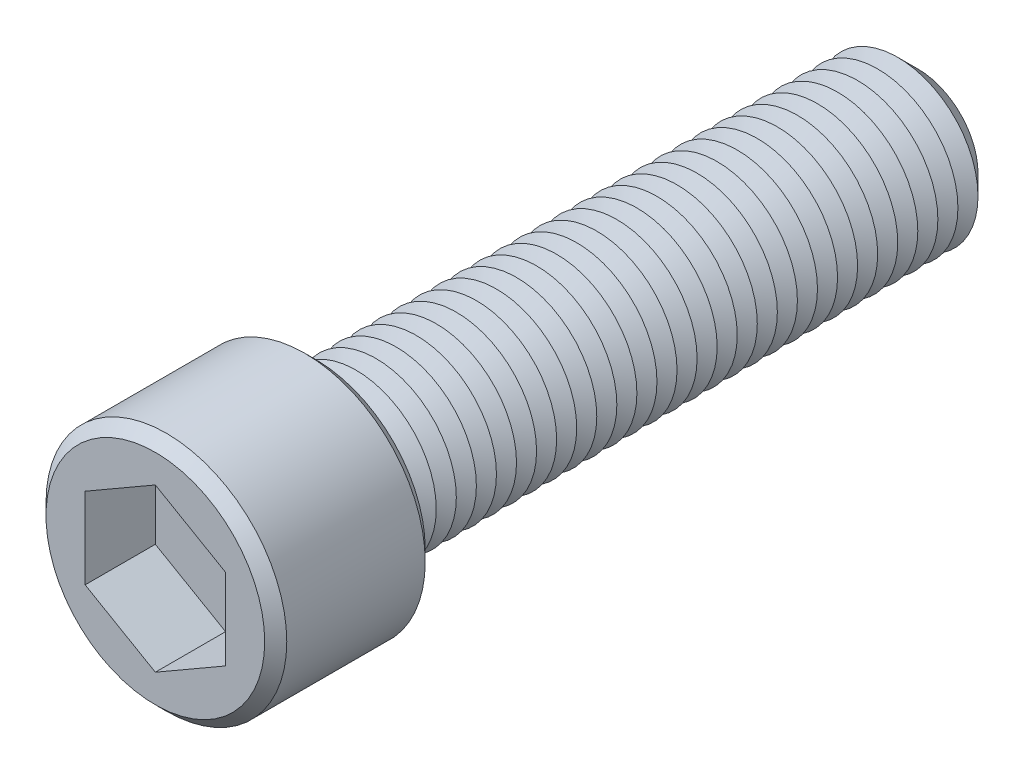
ISO-10303-21;
HEADER;
FILE_DESCRIPTION(('STEP AP214'),'2;1');
FILE_NAME('part.step','',(''),(''),'','','');
FILE_SCHEMA(('AUTOMOTIVE_DESIGN { 1 0 10303 214 1 1 1 1 }'));
ENDSEC;
DATA;
#1=APPLICATION_CONTEXT('core data for automotive mechanical design processes');
#2=APPLICATION_PROTOCOL_DEFINITION('international standard','automotive_design',2000,#1);
#3=PRODUCT_CONTEXT('',#1,'mechanical');
#4=PRODUCT('Part','Part','',(#3));
#5=PRODUCT_RELATED_PRODUCT_CATEGORY('part','',(#4));
#6=PRODUCT_DEFINITION_FORMATION('','',#4);
#7=PRODUCT_DEFINITION_CONTEXT('part definition',#1,'design');
#8=PRODUCT_DEFINITION('design','',#6,#7);
#9=PRODUCT_DEFINITION_SHAPE('','',#8);
#10=(LENGTH_UNIT() NAMED_UNIT(*) SI_UNIT(.MILLI.,.METRE.));
#11=(NAMED_UNIT(*) PLANE_ANGLE_UNIT() SI_UNIT($,.RADIAN.));
#12=(NAMED_UNIT(*) SI_UNIT($,.STERADIAN.) SOLID_ANGLE_UNIT());
#13=UNCERTAINTY_MEASURE_WITH_UNIT(LENGTH_MEASURE(1.E-05),#10,'distance_accuracy_value','');
#14=(GEOMETRIC_REPRESENTATION_CONTEXT(3) GLOBAL_UNCERTAINTY_ASSIGNED_CONTEXT((#13)) GLOBAL_UNIT_ASSIGNED_CONTEXT((#10,
#11,#12)) REPRESENTATION_CONTEXT('',''));
#15=CARTESIAN_POINT('',(0.,0.,0.));
#16=DIRECTION('',(0.,0.,1.));
#17=DIRECTION('',(1.,0.,0.));
#18=AXIS2_PLACEMENT_3D('',#15,#16,#17);
#19=CARTESIAN_POINT('',(0.,0.,16.));
#20=DIRECTION('',(0.,0.,-1.));
#21=DIRECTION('',(-1.,0.,0.));
#22=AXIS2_PLACEMENT_3D('',#19,#20,#21);
#23=CYLINDRICAL_SURFACE('',#22,12.);
#24=CARTESIAN_POINT('',(0.,0.,1.10000000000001));
#25=DIRECTION('',(0.,0.,1.));
#26=DIRECTION('',(1.,0.,0.));
#27=AXIS2_PLACEMENT_3D('',#24,#25,#26);
#28=CIRCLE('',#27,12.);
#29=CARTESIAN_POINT('',(12.,0.,1.10000000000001));
#30=VERTEX_POINT('',#29);
#31=EDGE_CURVE('E408',#30,#30,#28,.T.);
#32=ORIENTED_EDGE('',*,*,#31,.T.);
#33=EDGE_LOOP('',(#32));
#34=FACE_BOUND('',#33,.T.);
#35=CARTESIAN_POINT('',(0.,0.,14.9));
#36=DIRECTION('',(0.,0.,1.));
#37=DIRECTION('',(1.,0.,0.));
#38=AXIS2_PLACEMENT_3D('',#35,#36,#37);
#39=CIRCLE('',#38,12.);
#40=CARTESIAN_POINT('',(12.,0.,14.9));
#41=VERTEX_POINT('',#40);
#42=EDGE_CURVE('E404',#41,#41,#39,.F.);
#43=ORIENTED_EDGE('',*,*,#42,.T.);
#44=EDGE_LOOP('',(#43));
#45=FACE_BOUND('',#44,.T.);
#46=ADVANCED_FACE('F38',(#34,#45),#23,.T.);
#47=CARTESIAN_POINT('',(0.,0.,16.));
#48=DIRECTION('',(0.,0.,1.));
#49=DIRECTION('',(1.,0.,0.));
#50=AXIS2_PLACEMENT_3D('',#47,#48,#49);
#51=PLANE('',#50);
#52=CARTESIAN_POINT('',(0.,0.,16.));
#53=DIRECTION('',(0.,0.,1.));
#54=DIRECTION('',(1.,0.,0.));
#55=AXIS2_PLACEMENT_3D('',#52,#53,#54);
#56=CIRCLE('',#55,10.9);
#57=CARTESIAN_POINT('',(10.9,0.,16.));
#58=VERTEX_POINT('',#57);
#59=EDGE_CURVE('E11',#58,#58,#56,.T.);
#60=ORIENTED_EDGE('',*,*,#59,.T.);
#61=EDGE_LOOP('',(#60));
#62=FACE_BOUND('',#61,.T.);
#63=DIRECTION('',(-0.866025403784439,0.5,0.));
#64=VECTOR('',#63,1.);
#65=CARTESIAN_POINT('',(7.,4.04145188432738,16.));
#66=LINE('',#65,#64);
#67=CARTESIAN_POINT('',(7.,4.04145188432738,16.));
#68=VERTEX_POINT('',#67);
#69=CARTESIAN_POINT('',(0.,8.08290376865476,16.));
#70=VERTEX_POINT('',#69);
#71=EDGE_CURVE('E54',#68,#70,#66,.T.);
#72=ORIENTED_EDGE('',*,*,#71,.F.);
#73=DIRECTION('',(0.,1.,0.));
#74=VECTOR('',#73,1.);
#75=CARTESIAN_POINT('',(7.,-4.04145188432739,16.));
#76=LINE('',#75,#74);
#77=CARTESIAN_POINT('',(7.,-4.04145188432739,16.));
#78=VERTEX_POINT('',#77);
#79=EDGE_CURVE('E150',#78,#68,#76,.T.);
#80=ORIENTED_EDGE('',*,*,#79,.F.);
#81=DIRECTION('',(0.866025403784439,0.5,0.));
#82=VECTOR('',#81,1.);
#83=CARTESIAN_POINT('',(0.,-8.08290376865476,16.));
#84=LINE('',#83,#82);
#85=CARTESIAN_POINT('',(0.,-8.08290376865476,16.));
#86=VERTEX_POINT('',#85);
#87=EDGE_CURVE('E147',#86,#78,#84,.T.);
#88=ORIENTED_EDGE('',*,*,#87,.F.);
#89=DIRECTION('',(0.866025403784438,-0.5,0.));
#90=VECTOR('',#89,1.);
#91=CARTESIAN_POINT('',(-7.,-4.04145188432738,16.));
#92=LINE('',#91,#90);
#93=CARTESIAN_POINT('',(-7.,-4.04145188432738,16.));
#94=VERTEX_POINT('',#93);
#95=EDGE_CURVE('E102',#94,#86,#92,.T.);
#96=ORIENTED_EDGE('',*,*,#95,.F.);
#97=DIRECTION('',(0.,-1.,0.));
#98=VECTOR('',#97,1.);
#99=CARTESIAN_POINT('',(-7.,4.04145188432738,16.));
#100=LINE('',#99,#98);
#101=CARTESIAN_POINT('',(-7.,4.04145188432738,16.));
#102=VERTEX_POINT('',#101);
#103=EDGE_CURVE('E141',#102,#94,#100,.T.);
#104=ORIENTED_EDGE('',*,*,#103,.F.);
#105=DIRECTION('',(-0.866025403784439,-0.5,0.));
#106=VECTOR('',#105,1.);
#107=CARTESIAN_POINT('',(0.,8.08290376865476,16.));
#108=LINE('',#107,#106);
#109=EDGE_CURVE('E136',#70,#102,#108,.T.);
#110=ORIENTED_EDGE('',*,*,#109,.F.);
#111=EDGE_LOOP('',(#72,#80,#88,#96,#104,#110));
#112=FACE_BOUND('',#111,.T.);
#113=ADVANCED_FACE('F426',(#62,#112),#51,.T.);
#114=CARTESIAN_POINT('',(0.,0.,0.));
#115=DIRECTION('',(0.,0.,1.));
#116=DIRECTION('',(1.,0.,0.));
#117=AXIS2_PLACEMENT_3D('',#114,#115,#116);
#118=PLANE('',#117);
#119=CARTESIAN_POINT('',(0.,0.,0.));
#120=DIRECTION('',(0.,0.,1.));
#121=DIRECTION('',(1.,0.,0.));
#122=AXIS2_PLACEMENT_3D('',#119,#120,#121);
#123=CIRCLE('',#122,10.9);
#124=CARTESIAN_POINT('',(10.9,0.,0.));
#125=VERTEX_POINT('',#124);
#126=EDGE_CURVE('E47',#125,#125,#123,.F.);
#127=ORIENTED_EDGE('',*,*,#126,.T.);
#128=EDGE_LOOP('',(#127));
#129=FACE_BOUND('',#128,.T.);
#130=CARTESIAN_POINT('',(0.,0.,0.));
#131=DIRECTION('',(0.,0.,1.));
#132=DIRECTION('',(1.,0.,0.));
#133=AXIS2_PLACEMENT_3D('',#130,#131,#132);
#134=CIRCLE('',#133,8.);
#135=CARTESIAN_POINT('',(8.,0.,0.));
#136=VERTEX_POINT('',#135);
#137=EDGE_CURVE('E396',#136,#136,#134,.T.);
#138=ORIENTED_EDGE('',*,*,#137,.T.);
#139=EDGE_LOOP('',(#138));
#140=FACE_BOUND('',#139,.T.);
#141=ADVANCED_FACE('F415',(#129,#140),#118,.F.);
#142=CARTESIAN_POINT('',(0.,0.,0.));
#143=DIRECTION('',(0.,0.,1.));
#144=DIRECTION('',(1.,0.,0.));
#145=AXIS2_PLACEMENT_3D('',#142,#143,#144);
#146=CONICAL_SURFACE('',#145,8.,1.0471975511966);
#147=CARTESIAN_POINT('',(0.,0.,-1.));
#148=DIRECTION('',(0.,0.,1.));
#149=DIRECTION('',(1.,0.,0.));
#150=AXIS2_PLACEMENT_3D('',#147,#148,#149);
#151=CIRCLE('',#150,6.26794919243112);
#152=CARTESIAN_POINT('',(6.26794919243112,0.,-1.));
#153=VERTEX_POINT('',#152);
#154=EDGE_CURVE('E392',#153,#153,#151,.T.);
#155=ORIENTED_EDGE('',*,*,#154,.T.);
#156=EDGE_LOOP('',(#155));
#157=FACE_BOUND('',#156,.T.);
#158=ORIENTED_EDGE('',*,*,#137,.F.);
#159=EDGE_LOOP('',(#158));
#160=FACE_BOUND('',#159,.T.);
#161=ADVANCED_FACE('F707',(#157,#160),#146,.T.);
#162=CARTESIAN_POINT('',(0.,0.,-1.));
#163=DIRECTION('',(0.,0.,-1.));
#164=DIRECTION('',(-1.,0.,0.));
#165=AXIS2_PLACEMENT_3D('',#162,#163,#164);
#166=CONICAL_SURFACE('',#165,6.26794919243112,1.0471975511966);
#167=CARTESIAN_POINT('',(0.,0.,-2.));
#168=DIRECTION('',(0.,0.,1.));
#169=DIRECTION('',(1.,0.,0.));
#170=AXIS2_PLACEMENT_3D('',#167,#168,#169);
#171=CIRCLE('',#170,8.);
#172=CARTESIAN_POINT('',(8.,0.,-2.));
#173=VERTEX_POINT('',#172);
#174=EDGE_CURVE('E388',#173,#173,#171,.T.);
#175=ORIENTED_EDGE('',*,*,#174,.T.);
#176=EDGE_LOOP('',(#175));
#177=FACE_BOUND('',#176,.T.);
#178=ORIENTED_EDGE('',*,*,#154,.F.);
#179=EDGE_LOOP('',(#178));
#180=FACE_BOUND('',#179,.T.);
#181=ADVANCED_FACE('F703',(#177,#180),#166,.T.);
#182=CARTESIAN_POINT('',(0.,0.,-2.));
#183=DIRECTION('',(0.,0.,1.));
#184=DIRECTION('',(1.,0.,0.));
#185=AXIS2_PLACEMENT_3D('',#182,#183,#184);
#186=CONICAL_SURFACE('',#185,8.,1.0471975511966);
#187=CARTESIAN_POINT('',(0.,0.,-3.));
#188=DIRECTION('',(0.,0.,1.));
#189=DIRECTION('',(1.,0.,0.));
#190=AXIS2_PLACEMENT_3D('',#187,#188,#189);
#191=CIRCLE('',#190,6.26794919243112);
#192=CARTESIAN_POINT('',(6.26794919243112,0.,-3.));
#193=VERTEX_POINT('',#192);
#194=EDGE_CURVE('E384',#193,#193,#191,.T.);
#195=ORIENTED_EDGE('',*,*,#194,.T.);
#196=EDGE_LOOP('',(#195));
#197=FACE_BOUND('',#196,.T.);
#198=ORIENTED_EDGE('',*,*,#174,.F.);
#199=EDGE_LOOP('',(#198));
#200=FACE_BOUND('',#199,.T.);
#201=ADVANCED_FACE('F699',(#197,#200),#186,.T.);
#202=CARTESIAN_POINT('',(0.,0.,-3.));
#203=DIRECTION('',(0.,0.,-1.));
#204=DIRECTION('',(-1.,0.,0.));
#205=AXIS2_PLACEMENT_3D('',#202,#203,#204);
#206=CONICAL_SURFACE('',#205,6.26794919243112,1.0471975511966);
#207=CARTESIAN_POINT('',(0.,0.,-4.));
#208=DIRECTION('',(0.,0.,1.));
#209=DIRECTION('',(1.,0.,0.));
#210=AXIS2_PLACEMENT_3D('',#207,#208,#209);
#211=CIRCLE('',#210,8.);
#212=CARTESIAN_POINT('',(8.,0.,-4.));
#213=VERTEX_POINT('',#212);
#214=EDGE_CURVE('E380',#213,#213,#211,.T.);
#215=ORIENTED_EDGE('',*,*,#214,.T.);
#216=EDGE_LOOP('',(#215));
#217=FACE_BOUND('',#216,.T.);
#218=ORIENTED_EDGE('',*,*,#194,.F.);
#219=EDGE_LOOP('',(#218));
#220=FACE_BOUND('',#219,.T.);
#221=ADVANCED_FACE('F695',(#217,#220),#206,.T.);
#222=CARTESIAN_POINT('',(0.,0.,-4.));
#223=DIRECTION('',(0.,0.,1.));
#224=DIRECTION('',(1.,0.,0.));
#225=AXIS2_PLACEMENT_3D('',#222,#223,#224);
#226=CONICAL_SURFACE('',#225,8.,1.0471975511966);
#227=CARTESIAN_POINT('',(0.,0.,-5.));
#228=DIRECTION('',(0.,0.,1.));
#229=DIRECTION('',(1.,0.,0.));
#230=AXIS2_PLACEMENT_3D('',#227,#228,#229);
#231=CIRCLE('',#230,6.26794919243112);
#232=CARTESIAN_POINT('',(6.26794919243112,0.,-5.));
#233=VERTEX_POINT('',#232);
#234=EDGE_CURVE('E376',#233,#233,#231,.T.);
#235=ORIENTED_EDGE('',*,*,#234,.T.);
#236=EDGE_LOOP('',(#235));
#237=FACE_BOUND('',#236,.T.);
#238=ORIENTED_EDGE('',*,*,#214,.F.);
#239=EDGE_LOOP('',(#238));
#240=FACE_BOUND('',#239,.T.);
#241=ADVANCED_FACE('F691',(#237,#240),#226,.T.);
#242=CARTESIAN_POINT('',(0.,0.,-5.));
#243=DIRECTION('',(0.,0.,-1.));
#244=DIRECTION('',(-1.,0.,0.));
#245=AXIS2_PLACEMENT_3D('',#242,#243,#244);
#246=CONICAL_SURFACE('',#245,6.26794919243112,1.0471975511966);
#247=CARTESIAN_POINT('',(0.,0.,-6.));
#248=DIRECTION('',(0.,0.,1.));
#249=DIRECTION('',(1.,0.,0.));
#250=AXIS2_PLACEMENT_3D('',#247,#248,#249);
#251=CIRCLE('',#250,8.);
#252=CARTESIAN_POINT('',(8.,0.,-6.));
#253=VERTEX_POINT('',#252);
#254=EDGE_CURVE('E372',#253,#253,#251,.T.);
#255=ORIENTED_EDGE('',*,*,#254,.T.);
#256=EDGE_LOOP('',(#255));
#257=FACE_BOUND('',#256,.T.);
#258=ORIENTED_EDGE('',*,*,#234,.F.);
#259=EDGE_LOOP('',(#258));
#260=FACE_BOUND('',#259,.T.);
#261=ADVANCED_FACE('F687',(#257,#260),#246,.T.);
#262=CARTESIAN_POINT('',(0.,0.,-6.));
#263=DIRECTION('',(0.,0.,1.));
#264=DIRECTION('',(1.,0.,0.));
#265=AXIS2_PLACEMENT_3D('',#262,#263,#264);
#266=CONICAL_SURFACE('',#265,8.,1.0471975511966);
#267=CARTESIAN_POINT('',(0.,0.,-7.));
#268=DIRECTION('',(0.,0.,1.));
#269=DIRECTION('',(1.,0.,0.));
#270=AXIS2_PLACEMENT_3D('',#267,#268,#269);
#271=CIRCLE('',#270,6.26794919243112);
#272=CARTESIAN_POINT('',(6.26794919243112,0.,-7.));
#273=VERTEX_POINT('',#272);
#274=EDGE_CURVE('E368',#273,#273,#271,.T.);
#275=ORIENTED_EDGE('',*,*,#274,.T.);
#276=EDGE_LOOP('',(#275));
#277=FACE_BOUND('',#276,.T.);
#278=ORIENTED_EDGE('',*,*,#254,.F.);
#279=EDGE_LOOP('',(#278));
#280=FACE_BOUND('',#279,.T.);
#281=ADVANCED_FACE('F683',(#277,#280),#266,.T.);
#282=CARTESIAN_POINT('',(0.,0.,-7.));
#283=DIRECTION('',(0.,0.,-1.));
#284=DIRECTION('',(-1.,0.,0.));
#285=AXIS2_PLACEMENT_3D('',#282,#283,#284);
#286=CONICAL_SURFACE('',#285,6.26794919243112,1.0471975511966);
#287=CARTESIAN_POINT('',(0.,0.,-8.));
#288=DIRECTION('',(0.,0.,1.));
#289=DIRECTION('',(1.,0.,0.));
#290=AXIS2_PLACEMENT_3D('',#287,#288,#289);
#291=CIRCLE('',#290,8.);
#292=CARTESIAN_POINT('',(8.,0.,-8.));
#293=VERTEX_POINT('',#292);
#294=EDGE_CURVE('E364',#293,#293,#291,.T.);
#295=ORIENTED_EDGE('',*,*,#294,.T.);
#296=EDGE_LOOP('',(#295));
#297=FACE_BOUND('',#296,.T.);
#298=ORIENTED_EDGE('',*,*,#274,.F.);
#299=EDGE_LOOP('',(#298));
#300=FACE_BOUND('',#299,.T.);
#301=ADVANCED_FACE('F679',(#297,#300),#286,.T.);
#302=CARTESIAN_POINT('',(0.,0.,-8.));
#303=DIRECTION('',(0.,0.,1.));
#304=DIRECTION('',(1.,0.,0.));
#305=AXIS2_PLACEMENT_3D('',#302,#303,#304);
#306=CONICAL_SURFACE('',#305,8.,1.0471975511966);
#307=CARTESIAN_POINT('',(0.,0.,-9.));
#308=DIRECTION('',(0.,0.,1.));
#309=DIRECTION('',(1.,0.,0.));
#310=AXIS2_PLACEMENT_3D('',#307,#308,#309);
#311=CIRCLE('',#310,6.26794919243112);
#312=CARTESIAN_POINT('',(6.26794919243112,0.,-9.));
#313=VERTEX_POINT('',#312);
#314=EDGE_CURVE('E360',#313,#313,#311,.T.);
#315=ORIENTED_EDGE('',*,*,#314,.T.);
#316=EDGE_LOOP('',(#315));
#317=FACE_BOUND('',#316,.T.);
#318=ORIENTED_EDGE('',*,*,#294,.F.);
#319=EDGE_LOOP('',(#318));
#320=FACE_BOUND('',#319,.T.);
#321=ADVANCED_FACE('F675',(#317,#320),#306,.T.);
#322=CARTESIAN_POINT('',(0.,0.,-9.));
#323=DIRECTION('',(0.,0.,-1.));
#324=DIRECTION('',(-1.,0.,0.));
#325=AXIS2_PLACEMENT_3D('',#322,#323,#324);
#326=CONICAL_SURFACE('',#325,6.26794919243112,1.0471975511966);
#327=CARTESIAN_POINT('',(0.,0.,-10.));
#328=DIRECTION('',(0.,0.,1.));
#329=DIRECTION('',(1.,0.,0.));
#330=AXIS2_PLACEMENT_3D('',#327,#328,#329);
#331=CIRCLE('',#330,8.);
#332=CARTESIAN_POINT('',(8.,0.,-10.));
#333=VERTEX_POINT('',#332);
#334=EDGE_CURVE('E356',#333,#333,#331,.T.);
#335=ORIENTED_EDGE('',*,*,#334,.T.);
#336=EDGE_LOOP('',(#335));
#337=FACE_BOUND('',#336,.T.);
#338=ORIENTED_EDGE('',*,*,#314,.F.);
#339=EDGE_LOOP('',(#338));
#340=FACE_BOUND('',#339,.T.);
#341=ADVANCED_FACE('F671',(#337,#340),#326,.T.);
#342=CARTESIAN_POINT('',(0.,0.,-10.));
#343=DIRECTION('',(0.,0.,1.));
#344=DIRECTION('',(1.,0.,0.));
#345=AXIS2_PLACEMENT_3D('',#342,#343,#344);
#346=CONICAL_SURFACE('',#345,8.,1.0471975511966);
#347=CARTESIAN_POINT('',(0.,0.,-11.));
#348=DIRECTION('',(0.,0.,1.));
#349=DIRECTION('',(1.,0.,0.));
#350=AXIS2_PLACEMENT_3D('',#347,#348,#349);
#351=CIRCLE('',#350,6.26794919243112);
#352=CARTESIAN_POINT('',(6.26794919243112,0.,-11.));
#353=VERTEX_POINT('',#352);
#354=EDGE_CURVE('E352',#353,#353,#351,.T.);
#355=ORIENTED_EDGE('',*,*,#354,.T.);
#356=EDGE_LOOP('',(#355));
#357=FACE_BOUND('',#356,.T.);
#358=ORIENTED_EDGE('',*,*,#334,.F.);
#359=EDGE_LOOP('',(#358));
#360=FACE_BOUND('',#359,.T.);
#361=ADVANCED_FACE('F667',(#357,#360),#346,.T.);
#362=CARTESIAN_POINT('',(0.,0.,-11.));
#363=DIRECTION('',(0.,0.,-1.));
#364=DIRECTION('',(-1.,0.,0.));
#365=AXIS2_PLACEMENT_3D('',#362,#363,#364);
#366=CONICAL_SURFACE('',#365,6.26794919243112,1.0471975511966);
#367=CARTESIAN_POINT('',(0.,0.,-12.));
#368=DIRECTION('',(0.,0.,1.));
#369=DIRECTION('',(1.,0.,0.));
#370=AXIS2_PLACEMENT_3D('',#367,#368,#369);
#371=CIRCLE('',#370,8.);
#372=CARTESIAN_POINT('',(8.,0.,-12.));
#373=VERTEX_POINT('',#372);
#374=EDGE_CURVE('E348',#373,#373,#371,.T.);
#375=ORIENTED_EDGE('',*,*,#374,.T.);
#376=EDGE_LOOP('',(#375));
#377=FACE_BOUND('',#376,.T.);
#378=ORIENTED_EDGE('',*,*,#354,.F.);
#379=EDGE_LOOP('',(#378));
#380=FACE_BOUND('',#379,.T.);
#381=ADVANCED_FACE('F663',(#377,#380),#366,.T.);
#382=CARTESIAN_POINT('',(0.,0.,-12.));
#383=DIRECTION('',(0.,0.,1.));
#384=DIRECTION('',(1.,0.,0.));
#385=AXIS2_PLACEMENT_3D('',#382,#383,#384);
#386=CONICAL_SURFACE('',#385,8.,1.0471975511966);
#387=CARTESIAN_POINT('',(0.,0.,-13.));
#388=DIRECTION('',(0.,0.,1.));
#389=DIRECTION('',(1.,0.,0.));
#390=AXIS2_PLACEMENT_3D('',#387,#388,#389);
#391=CIRCLE('',#390,6.26794919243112);
#392=CARTESIAN_POINT('',(6.26794919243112,0.,-13.));
#393=VERTEX_POINT('',#392);
#394=EDGE_CURVE('E344',#393,#393,#391,.T.);
#395=ORIENTED_EDGE('',*,*,#394,.T.);
#396=EDGE_LOOP('',(#395));
#397=FACE_BOUND('',#396,.T.);
#398=ORIENTED_EDGE('',*,*,#374,.F.);
#399=EDGE_LOOP('',(#398));
#400=FACE_BOUND('',#399,.T.);
#401=ADVANCED_FACE('F659',(#397,#400),#386,.T.);
#402=CARTESIAN_POINT('',(0.,0.,-13.));
#403=DIRECTION('',(0.,0.,-1.));
#404=DIRECTION('',(-1.,0.,0.));
#405=AXIS2_PLACEMENT_3D('',#402,#403,#404);
#406=CONICAL_SURFACE('',#405,6.26794919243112,1.0471975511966);
#407=CARTESIAN_POINT('',(0.,0.,-14.));
#408=DIRECTION('',(0.,0.,1.));
#409=DIRECTION('',(1.,0.,0.));
#410=AXIS2_PLACEMENT_3D('',#407,#408,#409);
#411=CIRCLE('',#410,8.);
#412=CARTESIAN_POINT('',(8.,0.,-14.));
#413=VERTEX_POINT('',#412);
#414=EDGE_CURVE('E340',#413,#413,#411,.T.);
#415=ORIENTED_EDGE('',*,*,#414,.T.);
#416=EDGE_LOOP('',(#415));
#417=FACE_BOUND('',#416,.T.);
#418=ORIENTED_EDGE('',*,*,#394,.F.);
#419=EDGE_LOOP('',(#418));
#420=FACE_BOUND('',#419,.T.);
#421=ADVANCED_FACE('F655',(#417,#420),#406,.T.);
#422=CARTESIAN_POINT('',(0.,0.,-14.));
#423=DIRECTION('',(0.,0.,1.));
#424=DIRECTION('',(1.,0.,0.));
#425=AXIS2_PLACEMENT_3D('',#422,#423,#424);
#426=CONICAL_SURFACE('',#425,8.,1.0471975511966);
#427=CARTESIAN_POINT('',(0.,0.,-15.));
#428=DIRECTION('',(0.,0.,1.));
#429=DIRECTION('',(1.,0.,0.));
#430=AXIS2_PLACEMENT_3D('',#427,#428,#429);
#431=CIRCLE('',#430,6.26794919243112);
#432=CARTESIAN_POINT('',(6.26794919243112,0.,-15.));
#433=VERTEX_POINT('',#432);
#434=EDGE_CURVE('E336',#433,#433,#431,.T.);
#435=ORIENTED_EDGE('',*,*,#434,.T.);
#436=EDGE_LOOP('',(#435));
#437=FACE_BOUND('',#436,.T.);
#438=ORIENTED_EDGE('',*,*,#414,.F.);
#439=EDGE_LOOP('',(#438));
#440=FACE_BOUND('',#439,.T.);
#441=ADVANCED_FACE('F651',(#437,#440),#426,.T.);
#442=CARTESIAN_POINT('',(0.,0.,-15.));
#443=DIRECTION('',(0.,0.,-1.));
#444=DIRECTION('',(-1.,0.,0.));
#445=AXIS2_PLACEMENT_3D('',#442,#443,#444);
#446=CONICAL_SURFACE('',#445,6.26794919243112,1.0471975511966);
#447=CARTESIAN_POINT('',(0.,0.,-16.));
#448=DIRECTION('',(0.,0.,1.));
#449=DIRECTION('',(1.,0.,0.));
#450=AXIS2_PLACEMENT_3D('',#447,#448,#449);
#451=CIRCLE('',#450,8.);
#452=CARTESIAN_POINT('',(8.,0.,-16.));
#453=VERTEX_POINT('',#452);
#454=EDGE_CURVE('E332',#453,#453,#451,.T.);
#455=ORIENTED_EDGE('',*,*,#454,.T.);
#456=EDGE_LOOP('',(#455));
#457=FACE_BOUND('',#456,.T.);
#458=ORIENTED_EDGE('',*,*,#434,.F.);
#459=EDGE_LOOP('',(#458));
#460=FACE_BOUND('',#459,.T.);
#461=ADVANCED_FACE('F647',(#457,#460),#446,.T.);
#462=CARTESIAN_POINT('',(0.,0.,-16.));
#463=DIRECTION('',(0.,0.,1.));
#464=DIRECTION('',(1.,0.,0.));
#465=AXIS2_PLACEMENT_3D('',#462,#463,#464);
#466=CONICAL_SURFACE('',#465,8.,1.0471975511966);
#467=CARTESIAN_POINT('',(0.,0.,-17.));
#468=DIRECTION('',(0.,0.,1.));
#469=DIRECTION('',(1.,0.,0.));
#470=AXIS2_PLACEMENT_3D('',#467,#468,#469);
#471=CIRCLE('',#470,6.26794919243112);
#472=CARTESIAN_POINT('',(6.26794919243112,0.,-17.));
#473=VERTEX_POINT('',#472);
#474=EDGE_CURVE('E328',#473,#473,#471,.T.);
#475=ORIENTED_EDGE('',*,*,#474,.T.);
#476=EDGE_LOOP('',(#475));
#477=FACE_BOUND('',#476,.T.);
#478=ORIENTED_EDGE('',*,*,#454,.F.);
#479=EDGE_LOOP('',(#478));
#480=FACE_BOUND('',#479,.T.);
#481=ADVANCED_FACE('F643',(#477,#480),#466,.T.);
#482=CARTESIAN_POINT('',(0.,0.,-17.));
#483=DIRECTION('',(0.,0.,-1.));
#484=DIRECTION('',(-1.,0.,0.));
#485=AXIS2_PLACEMENT_3D('',#482,#483,#484);
#486=CONICAL_SURFACE('',#485,6.26794919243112,1.0471975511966);
#487=CARTESIAN_POINT('',(0.,0.,-18.));
#488=DIRECTION('',(0.,0.,1.));
#489=DIRECTION('',(1.,0.,0.));
#490=AXIS2_PLACEMENT_3D('',#487,#488,#489);
#491=CIRCLE('',#490,8.);
#492=CARTESIAN_POINT('',(8.,0.,-18.));
#493=VERTEX_POINT('',#492);
#494=EDGE_CURVE('E324',#493,#493,#491,.T.);
#495=ORIENTED_EDGE('',*,*,#494,.T.);
#496=EDGE_LOOP('',(#495));
#497=FACE_BOUND('',#496,.T.);
#498=ORIENTED_EDGE('',*,*,#474,.F.);
#499=EDGE_LOOP('',(#498));
#500=FACE_BOUND('',#499,.T.);
#501=ADVANCED_FACE('F639',(#497,#500),#486,.T.);
#502=CARTESIAN_POINT('',(0.,0.,-18.));
#503=DIRECTION('',(0.,0.,1.));
#504=DIRECTION('',(1.,0.,0.));
#505=AXIS2_PLACEMENT_3D('',#502,#503,#504);
#506=CONICAL_SURFACE('',#505,8.,1.0471975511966);
#507=CARTESIAN_POINT('',(0.,0.,-19.));
#508=DIRECTION('',(0.,0.,1.));
#509=DIRECTION('',(1.,0.,0.));
#510=AXIS2_PLACEMENT_3D('',#507,#508,#509);
#511=CIRCLE('',#510,6.26794919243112);
#512=CARTESIAN_POINT('',(6.26794919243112,0.,-19.));
#513=VERTEX_POINT('',#512);
#514=EDGE_CURVE('E320',#513,#513,#511,.T.);
#515=ORIENTED_EDGE('',*,*,#514,.T.);
#516=EDGE_LOOP('',(#515));
#517=FACE_BOUND('',#516,.T.);
#518=ORIENTED_EDGE('',*,*,#494,.F.);
#519=EDGE_LOOP('',(#518));
#520=FACE_BOUND('',#519,.T.);
#521=ADVANCED_FACE('F635',(#517,#520),#506,.T.);
#522=CARTESIAN_POINT('',(0.,0.,-19.));
#523=DIRECTION('',(0.,0.,-1.));
#524=DIRECTION('',(-1.,0.,0.));
#525=AXIS2_PLACEMENT_3D('',#522,#523,#524);
#526=CONICAL_SURFACE('',#525,6.26794919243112,1.0471975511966);
#527=CARTESIAN_POINT('',(0.,0.,-20.));
#528=DIRECTION('',(0.,0.,1.));
#529=DIRECTION('',(1.,0.,0.));
#530=AXIS2_PLACEMENT_3D('',#527,#528,#529);
#531=CIRCLE('',#530,8.);
#532=CARTESIAN_POINT('',(8.,0.,-20.));
#533=VERTEX_POINT('',#532);
#534=EDGE_CURVE('E316',#533,#533,#531,.T.);
#535=ORIENTED_EDGE('',*,*,#534,.T.);
#536=EDGE_LOOP('',(#535));
#537=FACE_BOUND('',#536,.T.);
#538=ORIENTED_EDGE('',*,*,#514,.F.);
#539=EDGE_LOOP('',(#538));
#540=FACE_BOUND('',#539,.T.);
#541=ADVANCED_FACE('F631',(#537,#540),#526,.T.);
#542=CARTESIAN_POINT('',(0.,0.,-20.));
#543=DIRECTION('',(0.,0.,1.));
#544=DIRECTION('',(1.,0.,0.));
#545=AXIS2_PLACEMENT_3D('',#542,#543,#544);
#546=CONICAL_SURFACE('',#545,8.,1.0471975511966);
#547=CARTESIAN_POINT('',(0.,0.,-21.));
#548=DIRECTION('',(0.,0.,1.));
#549=DIRECTION('',(1.,0.,0.));
#550=AXIS2_PLACEMENT_3D('',#547,#548,#549);
#551=CIRCLE('',#550,6.26794919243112);
#552=CARTESIAN_POINT('',(6.26794919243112,0.,-21.));
#553=VERTEX_POINT('',#552);
#554=EDGE_CURVE('E312',#553,#553,#551,.T.);
#555=ORIENTED_EDGE('',*,*,#554,.T.);
#556=EDGE_LOOP('',(#555));
#557=FACE_BOUND('',#556,.T.);
#558=ORIENTED_EDGE('',*,*,#534,.F.);
#559=EDGE_LOOP('',(#558));
#560=FACE_BOUND('',#559,.T.);
#561=ADVANCED_FACE('F627',(#557,#560),#546,.T.);
#562=CARTESIAN_POINT('',(0.,0.,-21.));
#563=DIRECTION('',(0.,0.,-1.));
#564=DIRECTION('',(-1.,0.,0.));
#565=AXIS2_PLACEMENT_3D('',#562,#563,#564);
#566=CONICAL_SURFACE('',#565,6.26794919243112,1.0471975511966);
#567=CARTESIAN_POINT('',(0.,0.,-22.));
#568=DIRECTION('',(0.,0.,1.));
#569=DIRECTION('',(1.,0.,0.));
#570=AXIS2_PLACEMENT_3D('',#567,#568,#569);
#571=CIRCLE('',#570,8.);
#572=CARTESIAN_POINT('',(8.,0.,-22.));
#573=VERTEX_POINT('',#572);
#574=EDGE_CURVE('E308',#573,#573,#571,.T.);
#575=ORIENTED_EDGE('',*,*,#574,.T.);
#576=EDGE_LOOP('',(#575));
#577=FACE_BOUND('',#576,.T.);
#578=ORIENTED_EDGE('',*,*,#554,.F.);
#579=EDGE_LOOP('',(#578));
#580=FACE_BOUND('',#579,.T.);
#581=ADVANCED_FACE('F623',(#577,#580),#566,.T.);
#582=CARTESIAN_POINT('',(0.,0.,-22.));
#583=DIRECTION('',(0.,0.,1.));
#584=DIRECTION('',(1.,0.,0.));
#585=AXIS2_PLACEMENT_3D('',#582,#583,#584);
#586=CONICAL_SURFACE('',#585,8.,1.0471975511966);
#587=CARTESIAN_POINT('',(0.,0.,-23.));
#588=DIRECTION('',(0.,0.,1.));
#589=DIRECTION('',(1.,0.,0.));
#590=AXIS2_PLACEMENT_3D('',#587,#588,#589);
#591=CIRCLE('',#590,6.26794919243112);
#592=CARTESIAN_POINT('',(6.26794919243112,0.,-23.));
#593=VERTEX_POINT('',#592);
#594=EDGE_CURVE('E304',#593,#593,#591,.T.);
#595=ORIENTED_EDGE('',*,*,#594,.T.);
#596=EDGE_LOOP('',(#595));
#597=FACE_BOUND('',#596,.T.);
#598=ORIENTED_EDGE('',*,*,#574,.F.);
#599=EDGE_LOOP('',(#598));
#600=FACE_BOUND('',#599,.T.);
#601=ADVANCED_FACE('F619',(#597,#600),#586,.T.);
#602=CARTESIAN_POINT('',(0.,0.,-23.));
#603=DIRECTION('',(0.,0.,-1.));
#604=DIRECTION('',(-1.,0.,0.));
#605=AXIS2_PLACEMENT_3D('',#602,#603,#604);
#606=CONICAL_SURFACE('',#605,6.26794919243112,1.0471975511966);
#607=CARTESIAN_POINT('',(0.,0.,-24.));
#608=DIRECTION('',(0.,0.,1.));
#609=DIRECTION('',(1.,0.,0.));
#610=AXIS2_PLACEMENT_3D('',#607,#608,#609);
#611=CIRCLE('',#610,8.);
#612=CARTESIAN_POINT('',(8.,0.,-24.));
#613=VERTEX_POINT('',#612);
#614=EDGE_CURVE('E300',#613,#613,#611,.T.);
#615=ORIENTED_EDGE('',*,*,#614,.T.);
#616=EDGE_LOOP('',(#615));
#617=FACE_BOUND('',#616,.T.);
#618=ORIENTED_EDGE('',*,*,#594,.F.);
#619=EDGE_LOOP('',(#618));
#620=FACE_BOUND('',#619,.T.);
#621=ADVANCED_FACE('F615',(#617,#620),#606,.T.);
#622=CARTESIAN_POINT('',(0.,0.,-24.));
#623=DIRECTION('',(0.,0.,1.));
#624=DIRECTION('',(1.,0.,0.));
#625=AXIS2_PLACEMENT_3D('',#622,#623,#624);
#626=CONICAL_SURFACE('',#625,8.,1.0471975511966);
#627=CARTESIAN_POINT('',(0.,0.,-25.));
#628=DIRECTION('',(0.,0.,1.));
#629=DIRECTION('',(1.,0.,0.));
#630=AXIS2_PLACEMENT_3D('',#627,#628,#629);
#631=CIRCLE('',#630,6.26794919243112);
#632=CARTESIAN_POINT('',(6.26794919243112,0.,-25.));
#633=VERTEX_POINT('',#632);
#634=EDGE_CURVE('E296',#633,#633,#631,.T.);
#635=ORIENTED_EDGE('',*,*,#634,.T.);
#636=EDGE_LOOP('',(#635));
#637=FACE_BOUND('',#636,.T.);
#638=ORIENTED_EDGE('',*,*,#614,.F.);
#639=EDGE_LOOP('',(#638));
#640=FACE_BOUND('',#639,.T.);
#641=ADVANCED_FACE('F611',(#637,#640),#626,.T.);
#642=CARTESIAN_POINT('',(0.,0.,-25.));
#643=DIRECTION('',(0.,0.,-1.));
#644=DIRECTION('',(-1.,0.,0.));
#645=AXIS2_PLACEMENT_3D('',#642,#643,#644);
#646=CONICAL_SURFACE('',#645,6.26794919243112,1.0471975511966);
#647=CARTESIAN_POINT('',(0.,0.,-26.));
#648=DIRECTION('',(0.,0.,1.));
#649=DIRECTION('',(1.,0.,0.));
#650=AXIS2_PLACEMENT_3D('',#647,#648,#649);
#651=CIRCLE('',#650,8.);
#652=CARTESIAN_POINT('',(8.,0.,-26.));
#653=VERTEX_POINT('',#652);
#654=EDGE_CURVE('E292',#653,#653,#651,.T.);
#655=ORIENTED_EDGE('',*,*,#654,.T.);
#656=EDGE_LOOP('',(#655));
#657=FACE_BOUND('',#656,.T.);
#658=ORIENTED_EDGE('',*,*,#634,.F.);
#659=EDGE_LOOP('',(#658));
#660=FACE_BOUND('',#659,.T.);
#661=ADVANCED_FACE('F607',(#657,#660),#646,.T.);
#662=CARTESIAN_POINT('',(0.,0.,-26.));
#663=DIRECTION('',(0.,0.,1.));
#664=DIRECTION('',(1.,0.,0.));
#665=AXIS2_PLACEMENT_3D('',#662,#663,#664);
#666=CONICAL_SURFACE('',#665,8.,1.0471975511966);
#667=CARTESIAN_POINT('',(0.,0.,-27.));
#668=DIRECTION('',(0.,0.,1.));
#669=DIRECTION('',(1.,0.,0.));
#670=AXIS2_PLACEMENT_3D('',#667,#668,#669);
#671=CIRCLE('',#670,6.26794919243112);
#672=CARTESIAN_POINT('',(6.26794919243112,0.,-27.));
#673=VERTEX_POINT('',#672);
#674=EDGE_CURVE('E288',#673,#673,#671,.T.);
#675=ORIENTED_EDGE('',*,*,#674,.T.);
#676=EDGE_LOOP('',(#675));
#677=FACE_BOUND('',#676,.T.);
#678=ORIENTED_EDGE('',*,*,#654,.F.);
#679=EDGE_LOOP('',(#678));
#680=FACE_BOUND('',#679,.T.);
#681=ADVANCED_FACE('F603',(#677,#680),#666,.T.);
#682=CARTESIAN_POINT('',(0.,0.,-27.));
#683=DIRECTION('',(0.,0.,-1.));
#684=DIRECTION('',(-1.,0.,0.));
#685=AXIS2_PLACEMENT_3D('',#682,#683,#684);
#686=CONICAL_SURFACE('',#685,6.26794919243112,1.0471975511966);
#687=CARTESIAN_POINT('',(0.,0.,-28.));
#688=DIRECTION('',(0.,0.,1.));
#689=DIRECTION('',(1.,0.,0.));
#690=AXIS2_PLACEMENT_3D('',#687,#688,#689);
#691=CIRCLE('',#690,8.);
#692=CARTESIAN_POINT('',(8.,0.,-28.));
#693=VERTEX_POINT('',#692);
#694=EDGE_CURVE('E284',#693,#693,#691,.T.);
#695=ORIENTED_EDGE('',*,*,#694,.T.);
#696=EDGE_LOOP('',(#695));
#697=FACE_BOUND('',#696,.T.);
#698=ORIENTED_EDGE('',*,*,#674,.F.);
#699=EDGE_LOOP('',(#698));
#700=FACE_BOUND('',#699,.T.);
#701=ADVANCED_FACE('F599',(#697,#700),#686,.T.);
#702=CARTESIAN_POINT('',(0.,0.,-28.));
#703=DIRECTION('',(0.,0.,1.));
#704=DIRECTION('',(1.,0.,0.));
#705=AXIS2_PLACEMENT_3D('',#702,#703,#704);
#706=CONICAL_SURFACE('',#705,8.,1.0471975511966);
#707=CARTESIAN_POINT('',(0.,0.,-29.));
#708=DIRECTION('',(0.,0.,1.));
#709=DIRECTION('',(1.,0.,0.));
#710=AXIS2_PLACEMENT_3D('',#707,#708,#709);
#711=CIRCLE('',#710,6.26794919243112);
#712=CARTESIAN_POINT('',(6.26794919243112,0.,-29.));
#713=VERTEX_POINT('',#712);
#714=EDGE_CURVE('E280',#713,#713,#711,.T.);
#715=ORIENTED_EDGE('',*,*,#714,.T.);
#716=EDGE_LOOP('',(#715));
#717=FACE_BOUND('',#716,.T.);
#718=ORIENTED_EDGE('',*,*,#694,.F.);
#719=EDGE_LOOP('',(#718));
#720=FACE_BOUND('',#719,.T.);
#721=ADVANCED_FACE('F595',(#717,#720),#706,.T.);
#722=CARTESIAN_POINT('',(0.,0.,-29.));
#723=DIRECTION('',(0.,0.,-1.));
#724=DIRECTION('',(-1.,0.,0.));
#725=AXIS2_PLACEMENT_3D('',#722,#723,#724);
#726=CONICAL_SURFACE('',#725,6.26794919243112,1.0471975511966);
#727=CARTESIAN_POINT('',(0.,0.,-30.));
#728=DIRECTION('',(0.,0.,1.));
#729=DIRECTION('',(1.,0.,0.));
#730=AXIS2_PLACEMENT_3D('',#727,#728,#729);
#731=CIRCLE('',#730,8.);
#732=CARTESIAN_POINT('',(8.,0.,-30.));
#733=VERTEX_POINT('',#732);
#734=EDGE_CURVE('E276',#733,#733,#731,.T.);
#735=ORIENTED_EDGE('',*,*,#734,.T.);
#736=EDGE_LOOP('',(#735));
#737=FACE_BOUND('',#736,.T.);
#738=ORIENTED_EDGE('',*,*,#714,.F.);
#739=EDGE_LOOP('',(#738));
#740=FACE_BOUND('',#739,.T.);
#741=ADVANCED_FACE('F591',(#737,#740),#726,.T.);
#742=CARTESIAN_POINT('',(0.,0.,-30.));
#743=DIRECTION('',(0.,0.,1.));
#744=DIRECTION('',(1.,0.,0.));
#745=AXIS2_PLACEMENT_3D('',#742,#743,#744);
#746=CONICAL_SURFACE('',#745,8.,1.0471975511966);
#747=CARTESIAN_POINT('',(0.,0.,-31.));
#748=DIRECTION('',(0.,0.,1.));
#749=DIRECTION('',(1.,0.,0.));
#750=AXIS2_PLACEMENT_3D('',#747,#748,#749);
#751=CIRCLE('',#750,6.26794919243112);
#752=CARTESIAN_POINT('',(6.26794919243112,0.,-31.));
#753=VERTEX_POINT('',#752);
#754=EDGE_CURVE('E272',#753,#753,#751,.T.);
#755=ORIENTED_EDGE('',*,*,#754,.T.);
#756=EDGE_LOOP('',(#755));
#757=FACE_BOUND('',#756,.T.);
#758=ORIENTED_EDGE('',*,*,#734,.F.);
#759=EDGE_LOOP('',(#758));
#760=FACE_BOUND('',#759,.T.);
#761=ADVANCED_FACE('F587',(#757,#760),#746,.T.);
#762=CARTESIAN_POINT('',(0.,0.,-31.));
#763=DIRECTION('',(0.,0.,-1.));
#764=DIRECTION('',(-1.,0.,0.));
#765=AXIS2_PLACEMENT_3D('',#762,#763,#764);
#766=CONICAL_SURFACE('',#765,6.26794919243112,1.0471975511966);
#767=CARTESIAN_POINT('',(0.,0.,-32.));
#768=DIRECTION('',(0.,0.,1.));
#769=DIRECTION('',(1.,0.,0.));
#770=AXIS2_PLACEMENT_3D('',#767,#768,#769);
#771=CIRCLE('',#770,8.);
#772=CARTESIAN_POINT('',(8.,0.,-32.));
#773=VERTEX_POINT('',#772);
#774=EDGE_CURVE('E268',#773,#773,#771,.T.);
#775=ORIENTED_EDGE('',*,*,#774,.T.);
#776=EDGE_LOOP('',(#775));
#777=FACE_BOUND('',#776,.T.);
#778=ORIENTED_EDGE('',*,*,#754,.F.);
#779=EDGE_LOOP('',(#778));
#780=FACE_BOUND('',#779,.T.);
#781=ADVANCED_FACE('F583',(#777,#780),#766,.T.);
#782=CARTESIAN_POINT('',(0.,0.,-32.));
#783=DIRECTION('',(0.,0.,1.));
#784=DIRECTION('',(1.,0.,0.));
#785=AXIS2_PLACEMENT_3D('',#782,#783,#784);
#786=CONICAL_SURFACE('',#785,8.,1.0471975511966);
#787=CARTESIAN_POINT('',(0.,0.,-33.));
#788=DIRECTION('',(0.,0.,1.));
#789=DIRECTION('',(1.,0.,0.));
#790=AXIS2_PLACEMENT_3D('',#787,#788,#789);
#791=CIRCLE('',#790,6.26794919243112);
#792=CARTESIAN_POINT('',(6.26794919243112,0.,-33.));
#793=VERTEX_POINT('',#792);
#794=EDGE_CURVE('E264',#793,#793,#791,.T.);
#795=ORIENTED_EDGE('',*,*,#794,.T.);
#796=EDGE_LOOP('',(#795));
#797=FACE_BOUND('',#796,.T.);
#798=ORIENTED_EDGE('',*,*,#774,.F.);
#799=EDGE_LOOP('',(#798));
#800=FACE_BOUND('',#799,.T.);
#801=ADVANCED_FACE('F579',(#797,#800),#786,.T.);
#802=CARTESIAN_POINT('',(0.,0.,-33.));
#803=DIRECTION('',(0.,0.,-1.));
#804=DIRECTION('',(-1.,0.,0.));
#805=AXIS2_PLACEMENT_3D('',#802,#803,#804);
#806=CONICAL_SURFACE('',#805,6.26794919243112,1.0471975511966);
#807=CARTESIAN_POINT('',(0.,0.,-34.));
#808=DIRECTION('',(0.,0.,1.));
#809=DIRECTION('',(1.,0.,0.));
#810=AXIS2_PLACEMENT_3D('',#807,#808,#809);
#811=CIRCLE('',#810,8.);
#812=CARTESIAN_POINT('',(8.,0.,-34.));
#813=VERTEX_POINT('',#812);
#814=EDGE_CURVE('E260',#813,#813,#811,.T.);
#815=ORIENTED_EDGE('',*,*,#814,.T.);
#816=EDGE_LOOP('',(#815));
#817=FACE_BOUND('',#816,.T.);
#818=ORIENTED_EDGE('',*,*,#794,.F.);
#819=EDGE_LOOP('',(#818));
#820=FACE_BOUND('',#819,.T.);
#821=ADVANCED_FACE('F575',(#817,#820),#806,.T.);
#822=CARTESIAN_POINT('',(0.,0.,-34.));
#823=DIRECTION('',(0.,0.,1.));
#824=DIRECTION('',(1.,0.,0.));
#825=AXIS2_PLACEMENT_3D('',#822,#823,#824);
#826=CONICAL_SURFACE('',#825,8.,1.0471975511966);
#827=CARTESIAN_POINT('',(0.,0.,-35.));
#828=DIRECTION('',(0.,0.,1.));
#829=DIRECTION('',(1.,0.,0.));
#830=AXIS2_PLACEMENT_3D('',#827,#828,#829);
#831=CIRCLE('',#830,6.26794919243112);
#832=CARTESIAN_POINT('',(6.26794919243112,0.,-35.));
#833=VERTEX_POINT('',#832);
#834=EDGE_CURVE('E256',#833,#833,#831,.T.);
#835=ORIENTED_EDGE('',*,*,#834,.T.);
#836=EDGE_LOOP('',(#835));
#837=FACE_BOUND('',#836,.T.);
#838=ORIENTED_EDGE('',*,*,#814,.F.);
#839=EDGE_LOOP('',(#838));
#840=FACE_BOUND('',#839,.T.);
#841=ADVANCED_FACE('F571',(#837,#840),#826,.T.);
#842=CARTESIAN_POINT('',(0.,0.,-35.));
#843=DIRECTION('',(0.,0.,-1.));
#844=DIRECTION('',(-1.,0.,0.));
#845=AXIS2_PLACEMENT_3D('',#842,#843,#844);
#846=CONICAL_SURFACE('',#845,6.26794919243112,1.0471975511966);
#847=CARTESIAN_POINT('',(0.,0.,-36.));
#848=DIRECTION('',(0.,0.,1.));
#849=DIRECTION('',(1.,0.,0.));
#850=AXIS2_PLACEMENT_3D('',#847,#848,#849);
#851=CIRCLE('',#850,8.);
#852=CARTESIAN_POINT('',(8.,0.,-36.));
#853=VERTEX_POINT('',#852);
#854=EDGE_CURVE('E252',#853,#853,#851,.T.);
#855=ORIENTED_EDGE('',*,*,#854,.T.);
#856=EDGE_LOOP('',(#855));
#857=FACE_BOUND('',#856,.T.);
#858=ORIENTED_EDGE('',*,*,#834,.F.);
#859=EDGE_LOOP('',(#858));
#860=FACE_BOUND('',#859,.T.);
#861=ADVANCED_FACE('F567',(#857,#860),#846,.T.);
#862=CARTESIAN_POINT('',(0.,0.,-36.));
#863=DIRECTION('',(0.,0.,1.));
#864=DIRECTION('',(1.,0.,0.));
#865=AXIS2_PLACEMENT_3D('',#862,#863,#864);
#866=CONICAL_SURFACE('',#865,8.,1.0471975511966);
#867=CARTESIAN_POINT('',(0.,0.,-37.));
#868=DIRECTION('',(0.,0.,1.));
#869=DIRECTION('',(1.,0.,0.));
#870=AXIS2_PLACEMENT_3D('',#867,#868,#869);
#871=CIRCLE('',#870,6.26794919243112);
#872=CARTESIAN_POINT('',(6.26794919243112,0.,-37.));
#873=VERTEX_POINT('',#872);
#874=EDGE_CURVE('E248',#873,#873,#871,.T.);
#875=ORIENTED_EDGE('',*,*,#874,.T.);
#876=EDGE_LOOP('',(#875));
#877=FACE_BOUND('',#876,.T.);
#878=ORIENTED_EDGE('',*,*,#854,.F.);
#879=EDGE_LOOP('',(#878));
#880=FACE_BOUND('',#879,.T.);
#881=ADVANCED_FACE('F563',(#877,#880),#866,.T.);
#882=CARTESIAN_POINT('',(0.,0.,-37.));
#883=DIRECTION('',(0.,0.,-1.));
#884=DIRECTION('',(-1.,0.,0.));
#885=AXIS2_PLACEMENT_3D('',#882,#883,#884);
#886=CONICAL_SURFACE('',#885,6.26794919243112,1.0471975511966);
#887=CARTESIAN_POINT('',(0.,0.,-38.));
#888=DIRECTION('',(0.,0.,1.));
#889=DIRECTION('',(1.,0.,0.));
#890=AXIS2_PLACEMENT_3D('',#887,#888,#889);
#891=CIRCLE('',#890,8.);
#892=CARTESIAN_POINT('',(8.,0.,-38.));
#893=VERTEX_POINT('',#892);
#894=EDGE_CURVE('E244',#893,#893,#891,.T.);
#895=ORIENTED_EDGE('',*,*,#894,.T.);
#896=EDGE_LOOP('',(#895));
#897=FACE_BOUND('',#896,.T.);
#898=ORIENTED_EDGE('',*,*,#874,.F.);
#899=EDGE_LOOP('',(#898));
#900=FACE_BOUND('',#899,.T.);
#901=ADVANCED_FACE('F559',(#897,#900),#886,.T.);
#902=CARTESIAN_POINT('',(0.,0.,-38.));
#903=DIRECTION('',(0.,0.,1.));
#904=DIRECTION('',(1.,0.,0.));
#905=AXIS2_PLACEMENT_3D('',#902,#903,#904);
#906=CONICAL_SURFACE('',#905,8.,1.0471975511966);
#907=CARTESIAN_POINT('',(0.,0.,-39.));
#908=DIRECTION('',(0.,0.,1.));
#909=DIRECTION('',(1.,0.,0.));
#910=AXIS2_PLACEMENT_3D('',#907,#908,#909);
#911=CIRCLE('',#910,6.26794919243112);
#912=CARTESIAN_POINT('',(6.26794919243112,0.,-39.));
#913=VERTEX_POINT('',#912);
#914=EDGE_CURVE('E240',#913,#913,#911,.T.);
#915=ORIENTED_EDGE('',*,*,#914,.T.);
#916=EDGE_LOOP('',(#915));
#917=FACE_BOUND('',#916,.T.);
#918=ORIENTED_EDGE('',*,*,#894,.F.);
#919=EDGE_LOOP('',(#918));
#920=FACE_BOUND('',#919,.T.);
#921=ADVANCED_FACE('F555',(#917,#920),#906,.T.);
#922=CARTESIAN_POINT('',(0.,0.,-39.));
#923=DIRECTION('',(0.,0.,-1.));
#924=DIRECTION('',(-1.,0.,0.));
#925=AXIS2_PLACEMENT_3D('',#922,#923,#924);
#926=CONICAL_SURFACE('',#925,6.26794919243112,1.0471975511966);
#927=CARTESIAN_POINT('',(0.,0.,-40.));
#928=DIRECTION('',(0.,0.,1.));
#929=DIRECTION('',(1.,0.,0.));
#930=AXIS2_PLACEMENT_3D('',#927,#928,#929);
#931=CIRCLE('',#930,8.);
#932=CARTESIAN_POINT('',(8.,0.,-40.));
#933=VERTEX_POINT('',#932);
#934=EDGE_CURVE('E236',#933,#933,#931,.T.);
#935=ORIENTED_EDGE('',*,*,#934,.T.);
#936=EDGE_LOOP('',(#935));
#937=FACE_BOUND('',#936,.T.);
#938=ORIENTED_EDGE('',*,*,#914,.F.);
#939=EDGE_LOOP('',(#938));
#940=FACE_BOUND('',#939,.T.);
#941=ADVANCED_FACE('F551',(#937,#940),#926,.T.);
#942=CARTESIAN_POINT('',(0.,0.,-40.));
#943=DIRECTION('',(0.,0.,1.));
#944=DIRECTION('',(1.,0.,0.));
#945=AXIS2_PLACEMENT_3D('',#942,#943,#944);
#946=CONICAL_SURFACE('',#945,8.,1.0471975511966);
#947=CARTESIAN_POINT('',(0.,0.,-41.));
#948=DIRECTION('',(0.,0.,1.));
#949=DIRECTION('',(1.,0.,0.));
#950=AXIS2_PLACEMENT_3D('',#947,#948,#949);
#951=CIRCLE('',#950,6.26794919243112);
#952=CARTESIAN_POINT('',(6.26794919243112,0.,-41.));
#953=VERTEX_POINT('',#952);
#954=EDGE_CURVE('E232',#953,#953,#951,.T.);
#955=ORIENTED_EDGE('',*,*,#954,.T.);
#956=EDGE_LOOP('',(#955));
#957=FACE_BOUND('',#956,.T.);
#958=ORIENTED_EDGE('',*,*,#934,.F.);
#959=EDGE_LOOP('',(#958));
#960=FACE_BOUND('',#959,.T.);
#961=ADVANCED_FACE('F547',(#957,#960),#946,.T.);
#962=CARTESIAN_POINT('',(0.,0.,-41.));
#963=DIRECTION('',(0.,0.,-1.));
#964=DIRECTION('',(-1.,0.,0.));
#965=AXIS2_PLACEMENT_3D('',#962,#963,#964);
#966=CONICAL_SURFACE('',#965,6.26794919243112,1.0471975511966);
#967=CARTESIAN_POINT('',(0.,0.,-42.));
#968=DIRECTION('',(0.,0.,1.));
#969=DIRECTION('',(1.,0.,0.));
#970=AXIS2_PLACEMENT_3D('',#967,#968,#969);
#971=CIRCLE('',#970,8.);
#972=CARTESIAN_POINT('',(8.,0.,-42.));
#973=VERTEX_POINT('',#972);
#974=EDGE_CURVE('E228',#973,#973,#971,.T.);
#975=ORIENTED_EDGE('',*,*,#974,.T.);
#976=EDGE_LOOP('',(#975));
#977=FACE_BOUND('',#976,.T.);
#978=ORIENTED_EDGE('',*,*,#954,.F.);
#979=EDGE_LOOP('',(#978));
#980=FACE_BOUND('',#979,.T.);
#981=ADVANCED_FACE('F543',(#977,#980),#966,.T.);
#982=CARTESIAN_POINT('',(0.,0.,-42.));
#983=DIRECTION('',(0.,0.,1.));
#984=DIRECTION('',(1.,0.,0.));
#985=AXIS2_PLACEMENT_3D('',#982,#983,#984);
#986=CONICAL_SURFACE('',#985,8.,1.0471975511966);
#987=CARTESIAN_POINT('',(0.,0.,-43.));
#988=DIRECTION('',(0.,0.,1.));
#989=DIRECTION('',(1.,0.,0.));
#990=AXIS2_PLACEMENT_3D('',#987,#988,#989);
#991=CIRCLE('',#990,6.26794919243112);
#992=CARTESIAN_POINT('',(6.26794919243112,0.,-43.));
#993=VERTEX_POINT('',#992);
#994=EDGE_CURVE('E224',#993,#993,#991,.T.);
#995=ORIENTED_EDGE('',*,*,#994,.T.);
#996=EDGE_LOOP('',(#995));
#997=FACE_BOUND('',#996,.T.);
#998=ORIENTED_EDGE('',*,*,#974,.F.);
#999=EDGE_LOOP('',(#998));
#1000=FACE_BOUND('',#999,.T.);
#1001=ADVANCED_FACE('F539',(#997,#1000),#986,.T.);
#1002=CARTESIAN_POINT('',(0.,0.,-43.));
#1003=DIRECTION('',(0.,0.,-1.));
#1004=DIRECTION('',(-1.,0.,0.));
#1005=AXIS2_PLACEMENT_3D('',#1002,#1003,#1004);
#1006=CONICAL_SURFACE('',#1005,6.26794919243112,1.0471975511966);
#1007=CARTESIAN_POINT('',(0.,0.,-44.));
#1008=DIRECTION('',(0.,0.,1.));
#1009=DIRECTION('',(1.,0.,0.));
#1010=AXIS2_PLACEMENT_3D('',#1007,#1008,#1009);
#1011=CIRCLE('',#1010,8.);
#1012=CARTESIAN_POINT('',(8.,0.,-44.));
#1013=VERTEX_POINT('',#1012);
#1014=EDGE_CURVE('E220',#1013,#1013,#1011,.T.);
#1015=ORIENTED_EDGE('',*,*,#1014,.T.);
#1016=EDGE_LOOP('',(#1015));
#1017=FACE_BOUND('',#1016,.T.);
#1018=ORIENTED_EDGE('',*,*,#994,.F.);
#1019=EDGE_LOOP('',(#1018));
#1020=FACE_BOUND('',#1019,.T.);
#1021=ADVANCED_FACE('F535',(#1017,#1020),#1006,.T.);
#1022=CARTESIAN_POINT('',(0.,0.,-44.));
#1023=DIRECTION('',(0.,0.,1.));
#1024=DIRECTION('',(1.,0.,0.));
#1025=AXIS2_PLACEMENT_3D('',#1022,#1023,#1024);
#1026=CONICAL_SURFACE('',#1025,8.,1.0471975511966);
#1027=CARTESIAN_POINT('',(0.,0.,-45.));
#1028=DIRECTION('',(0.,0.,1.));
#1029=DIRECTION('',(1.,0.,0.));
#1030=AXIS2_PLACEMENT_3D('',#1027,#1028,#1029);
#1031=CIRCLE('',#1030,6.26794919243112);
#1032=CARTESIAN_POINT('',(6.26794919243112,0.,-45.));
#1033=VERTEX_POINT('',#1032);
#1034=EDGE_CURVE('E216',#1033,#1033,#1031,.T.);
#1035=ORIENTED_EDGE('',*,*,#1034,.T.);
#1036=EDGE_LOOP('',(#1035));
#1037=FACE_BOUND('',#1036,.T.);
#1038=ORIENTED_EDGE('',*,*,#1014,.F.);
#1039=EDGE_LOOP('',(#1038));
#1040=FACE_BOUND('',#1039,.T.);
#1041=ADVANCED_FACE('F531',(#1037,#1040),#1026,.T.);
#1042=CARTESIAN_POINT('',(0.,0.,-45.));
#1043=DIRECTION('',(0.,0.,-1.));
#1044=DIRECTION('',(-1.,0.,0.));
#1045=AXIS2_PLACEMENT_3D('',#1042,#1043,#1044);
#1046=CONICAL_SURFACE('',#1045,6.26794919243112,1.0471975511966);
#1047=CARTESIAN_POINT('',(0.,0.,-46.));
#1048=DIRECTION('',(0.,0.,1.));
#1049=DIRECTION('',(1.,0.,0.));
#1050=AXIS2_PLACEMENT_3D('',#1047,#1048,#1049);
#1051=CIRCLE('',#1050,8.);
#1052=CARTESIAN_POINT('',(8.,0.,-46.));
#1053=VERTEX_POINT('',#1052);
#1054=EDGE_CURVE('E212',#1053,#1053,#1051,.T.);
#1055=ORIENTED_EDGE('',*,*,#1054,.T.);
#1056=EDGE_LOOP('',(#1055));
#1057=FACE_BOUND('',#1056,.T.);
#1058=ORIENTED_EDGE('',*,*,#1034,.F.);
#1059=EDGE_LOOP('',(#1058));
#1060=FACE_BOUND('',#1059,.T.);
#1061=ADVANCED_FACE('F527',(#1057,#1060),#1046,.T.);
#1062=CARTESIAN_POINT('',(0.,0.,-46.));
#1063=DIRECTION('',(0.,0.,1.));
#1064=DIRECTION('',(1.,0.,0.));
#1065=AXIS2_PLACEMENT_3D('',#1062,#1063,#1064);
#1066=CONICAL_SURFACE('',#1065,8.,1.0471975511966);
#1067=CARTESIAN_POINT('',(0.,0.,-47.));
#1068=DIRECTION('',(0.,0.,1.));
#1069=DIRECTION('',(1.,0.,0.));
#1070=AXIS2_PLACEMENT_3D('',#1067,#1068,#1069);
#1071=CIRCLE('',#1070,6.26794919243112);
#1072=CARTESIAN_POINT('',(6.26794919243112,0.,-47.));
#1073=VERTEX_POINT('',#1072);
#1074=EDGE_CURVE('E208',#1073,#1073,#1071,.T.);
#1075=ORIENTED_EDGE('',*,*,#1074,.T.);
#1076=EDGE_LOOP('',(#1075));
#1077=FACE_BOUND('',#1076,.T.);
#1078=ORIENTED_EDGE('',*,*,#1054,.F.);
#1079=EDGE_LOOP('',(#1078));
#1080=FACE_BOUND('',#1079,.T.);
#1081=ADVANCED_FACE('F523',(#1077,#1080),#1066,.T.);
#1082=CARTESIAN_POINT('',(0.,0.,-47.));
#1083=DIRECTION('',(0.,0.,-1.));
#1084=DIRECTION('',(-1.,0.,0.));
#1085=AXIS2_PLACEMENT_3D('',#1082,#1083,#1084);
#1086=CONICAL_SURFACE('',#1085,6.26794919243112,1.0471975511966);
#1087=CARTESIAN_POINT('',(0.,0.,-48.));
#1088=DIRECTION('',(0.,0.,1.));
#1089=DIRECTION('',(1.,0.,0.));
#1090=AXIS2_PLACEMENT_3D('',#1087,#1088,#1089);
#1091=CIRCLE('',#1090,8.);
#1092=CARTESIAN_POINT('',(8.,0.,-48.));
#1093=VERTEX_POINT('',#1092);
#1094=EDGE_CURVE('E204',#1093,#1093,#1091,.T.);
#1095=ORIENTED_EDGE('',*,*,#1094,.T.);
#1096=EDGE_LOOP('',(#1095));
#1097=FACE_BOUND('',#1096,.T.);
#1098=ORIENTED_EDGE('',*,*,#1074,.F.);
#1099=EDGE_LOOP('',(#1098));
#1100=FACE_BOUND('',#1099,.T.);
#1101=ADVANCED_FACE('F519',(#1097,#1100),#1086,.T.);
#1102=CARTESIAN_POINT('',(0.,0.,-48.));
#1103=DIRECTION('',(0.,0.,1.));
#1104=DIRECTION('',(1.,0.,0.));
#1105=AXIS2_PLACEMENT_3D('',#1102,#1103,#1104);
#1106=CONICAL_SURFACE('',#1105,8.,1.0471975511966);
#1107=CARTESIAN_POINT('',(0.,0.,-49.));
#1108=DIRECTION('',(0.,0.,1.));
#1109=DIRECTION('',(1.,0.,0.));
#1110=AXIS2_PLACEMENT_3D('',#1107,#1108,#1109);
#1111=CIRCLE('',#1110,6.26794919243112);
#1112=CARTESIAN_POINT('',(6.26794919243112,0.,-49.));
#1113=VERTEX_POINT('',#1112);
#1114=EDGE_CURVE('E200',#1113,#1113,#1111,.T.);
#1115=ORIENTED_EDGE('',*,*,#1114,.T.);
#1116=EDGE_LOOP('',(#1115));
#1117=FACE_BOUND('',#1116,.T.);
#1118=ORIENTED_EDGE('',*,*,#1094,.F.);
#1119=EDGE_LOOP('',(#1118));
#1120=FACE_BOUND('',#1119,.T.);
#1121=ADVANCED_FACE('F515',(#1117,#1120),#1106,.T.);
#1122=CARTESIAN_POINT('',(0.,0.,-49.));
#1123=DIRECTION('',(0.,0.,-1.));
#1124=DIRECTION('',(-1.,0.,0.));
#1125=AXIS2_PLACEMENT_3D('',#1122,#1123,#1124);
#1126=CONICAL_SURFACE('',#1125,6.26794919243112,1.0471975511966);
#1127=CARTESIAN_POINT('',(0.,0.,-50.));
#1128=DIRECTION('',(0.,0.,1.));
#1129=DIRECTION('',(1.,0.,0.));
#1130=AXIS2_PLACEMENT_3D('',#1127,#1128,#1129);
#1131=CIRCLE('',#1130,8.);
#1132=CARTESIAN_POINT('',(8.,0.,-50.));
#1133=VERTEX_POINT('',#1132);
#1134=EDGE_CURVE('E196',#1133,#1133,#1131,.T.);
#1135=ORIENTED_EDGE('',*,*,#1134,.T.);
#1136=EDGE_LOOP('',(#1135));
#1137=FACE_BOUND('',#1136,.T.);
#1138=ORIENTED_EDGE('',*,*,#1114,.F.);
#1139=EDGE_LOOP('',(#1138));
#1140=FACE_BOUND('',#1139,.T.);
#1141=ADVANCED_FACE('F511',(#1137,#1140),#1126,.T.);
#1142=CARTESIAN_POINT('',(0.,0.,-50.));
#1143=DIRECTION('',(0.,0.,1.));
#1144=DIRECTION('',(1.,0.,0.));
#1145=AXIS2_PLACEMENT_3D('',#1142,#1143,#1144);
#1146=CONICAL_SURFACE('',#1145,8.,1.0471975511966);
#1147=CARTESIAN_POINT('',(0.,0.,-51.));
#1148=DIRECTION('',(0.,0.,1.));
#1149=DIRECTION('',(1.,0.,0.));
#1150=AXIS2_PLACEMENT_3D('',#1147,#1148,#1149);
#1151=CIRCLE('',#1150,6.26794919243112);
#1152=CARTESIAN_POINT('',(6.26794919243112,0.,-51.));
#1153=VERTEX_POINT('',#1152);
#1154=EDGE_CURVE('E192',#1153,#1153,#1151,.T.);
#1155=ORIENTED_EDGE('',*,*,#1154,.T.);
#1156=EDGE_LOOP('',(#1155));
#1157=FACE_BOUND('',#1156,.T.);
#1158=ORIENTED_EDGE('',*,*,#1134,.F.);
#1159=EDGE_LOOP('',(#1158));
#1160=FACE_BOUND('',#1159,.T.);
#1161=ADVANCED_FACE('F507',(#1157,#1160),#1146,.T.);
#1162=CARTESIAN_POINT('',(0.,0.,-51.));
#1163=DIRECTION('',(0.,0.,-1.));
#1164=DIRECTION('',(-1.,0.,0.));
#1165=AXIS2_PLACEMENT_3D('',#1162,#1163,#1164);
#1166=CONICAL_SURFACE('',#1165,6.26794919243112,1.0471975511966);
#1167=CARTESIAN_POINT('',(0.,0.,-52.));
#1168=DIRECTION('',(0.,0.,1.));
#1169=DIRECTION('',(1.,0.,0.));
#1170=AXIS2_PLACEMENT_3D('',#1167,#1168,#1169);
#1171=CIRCLE('',#1170,8.);
#1172=CARTESIAN_POINT('',(8.,0.,-52.));
#1173=VERTEX_POINT('',#1172);
#1174=EDGE_CURVE('E188',#1173,#1173,#1171,.T.);
#1175=ORIENTED_EDGE('',*,*,#1174,.T.);
#1176=EDGE_LOOP('',(#1175));
#1177=FACE_BOUND('',#1176,.T.);
#1178=ORIENTED_EDGE('',*,*,#1154,.F.);
#1179=EDGE_LOOP('',(#1178));
#1180=FACE_BOUND('',#1179,.T.);
#1181=ADVANCED_FACE('F503',(#1177,#1180),#1166,.T.);
#1182=CARTESIAN_POINT('',(0.,0.,-52.));
#1183=DIRECTION('',(0.,0.,1.));
#1184=DIRECTION('',(1.,0.,0.));
#1185=AXIS2_PLACEMENT_3D('',#1182,#1183,#1184);
#1186=CONICAL_SURFACE('',#1185,8.,1.0471975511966);
#1187=CARTESIAN_POINT('',(0.,0.,-53.));
#1188=DIRECTION('',(0.,0.,1.));
#1189=DIRECTION('',(1.,0.,0.));
#1190=AXIS2_PLACEMENT_3D('',#1187,#1188,#1189);
#1191=CIRCLE('',#1190,6.26794919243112);
#1192=CARTESIAN_POINT('',(6.26794919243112,0.,-53.));
#1193=VERTEX_POINT('',#1192);
#1194=EDGE_CURVE('E185',#1193,#1193,#1191,.T.);
#1195=ORIENTED_EDGE('',*,*,#1194,.T.);
#1196=EDGE_LOOP('',(#1195));
#1197=FACE_BOUND('',#1196,.T.);
#1198=ORIENTED_EDGE('',*,*,#1174,.F.);
#1199=EDGE_LOOP('',(#1198));
#1200=FACE_BOUND('',#1199,.T.);
#1201=ADVANCED_FACE('F499',(#1197,#1200),#1186,.T.);
#1202=CARTESIAN_POINT('',(0.,0.,-53.));
#1203=DIRECTION('',(0.,0.,-1.));
#1204=DIRECTION('',(-1.,0.,0.));
#1205=AXIS2_PLACEMENT_3D('',#1202,#1203,#1204);
#1206=CONICAL_SURFACE('',#1205,6.26794919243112,1.0471975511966);
#1207=CARTESIAN_POINT('',(0.,0.,-54.));
#1208=DIRECTION('',(0.,0.,1.));
#1209=DIRECTION('',(1.,0.,0.));
#1210=AXIS2_PLACEMENT_3D('',#1207,#1208,#1209);
#1211=CIRCLE('',#1210,8.);
#1212=CARTESIAN_POINT('',(8.,0.,-54.));
#1213=VERTEX_POINT('',#1212);
#1214=EDGE_CURVE('E181',#1213,#1213,#1211,.T.);
#1215=ORIENTED_EDGE('',*,*,#1214,.T.);
#1216=EDGE_LOOP('',(#1215));
#1217=FACE_BOUND('',#1216,.T.);
#1218=ORIENTED_EDGE('',*,*,#1194,.F.);
#1219=EDGE_LOOP('',(#1218));
#1220=FACE_BOUND('',#1219,.T.);
#1221=ADVANCED_FACE('F495',(#1217,#1220),#1206,.T.);
#1222=CARTESIAN_POINT('',(0.,0.,-54.));
#1223=DIRECTION('',(0.,0.,1.));
#1224=DIRECTION('',(1.,0.,0.));
#1225=AXIS2_PLACEMENT_3D('',#1222,#1223,#1224);
#1226=CONICAL_SURFACE('',#1225,8.,1.0471975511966);
#1227=CARTESIAN_POINT('',(0.,0.,-55.));
#1228=DIRECTION('',(0.,0.,1.));
#1229=DIRECTION('',(1.,0.,0.));
#1230=AXIS2_PLACEMENT_3D('',#1227,#1228,#1229);
#1231=CIRCLE('',#1230,6.26794919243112);
#1232=CARTESIAN_POINT('',(6.26794919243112,0.,-55.));
#1233=VERTEX_POINT('',#1232);
#1234=EDGE_CURVE('E177',#1233,#1233,#1231,.T.);
#1235=ORIENTED_EDGE('',*,*,#1234,.T.);
#1236=EDGE_LOOP('',(#1235));
#1237=FACE_BOUND('',#1236,.T.);
#1238=ORIENTED_EDGE('',*,*,#1214,.F.);
#1239=EDGE_LOOP('',(#1238));
#1240=FACE_BOUND('',#1239,.T.);
#1241=ADVANCED_FACE('F491',(#1237,#1240),#1226,.T.);
#1242=CARTESIAN_POINT('',(0.,0.,-55.));
#1243=DIRECTION('',(0.,0.,-1.));
#1244=DIRECTION('',(-1.,0.,0.));
#1245=AXIS2_PLACEMENT_3D('',#1242,#1243,#1244);
#1246=CONICAL_SURFACE('',#1245,6.26794919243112,1.0471975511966);
#1247=CARTESIAN_POINT('',(0.,0.,-56.));
#1248=DIRECTION('',(0.,0.,1.));
#1249=DIRECTION('',(1.,0.,0.));
#1250=AXIS2_PLACEMENT_3D('',#1247,#1248,#1249);
#1251=CIRCLE('',#1250,8.);
#1252=CARTESIAN_POINT('',(8.,0.,-56.));
#1253=VERTEX_POINT('',#1252);
#1254=EDGE_CURVE('E173',#1253,#1253,#1251,.T.);
#1255=ORIENTED_EDGE('',*,*,#1254,.T.);
#1256=EDGE_LOOP('',(#1255));
#1257=FACE_BOUND('',#1256,.T.);
#1258=ORIENTED_EDGE('',*,*,#1234,.F.);
#1259=EDGE_LOOP('',(#1258));
#1260=FACE_BOUND('',#1259,.T.);
#1261=ADVANCED_FACE('F487',(#1257,#1260),#1246,.T.);
#1262=CARTESIAN_POINT('',(0.,0.,-56.));
#1263=DIRECTION('',(0.,0.,1.));
#1264=DIRECTION('',(1.,0.,0.));
#1265=AXIS2_PLACEMENT_3D('',#1262,#1263,#1264);
#1266=CONICAL_SURFACE('',#1265,8.,1.0471975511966);
#1267=CARTESIAN_POINT('',(0.,0.,-57.));
#1268=DIRECTION('',(0.,0.,1.));
#1269=DIRECTION('',(1.,0.,0.));
#1270=AXIS2_PLACEMENT_3D('',#1267,#1268,#1269);
#1271=CIRCLE('',#1270,6.26794919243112);
#1272=CARTESIAN_POINT('',(6.26794919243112,0.,-57.));
#1273=VERTEX_POINT('',#1272);
#1274=EDGE_CURVE('E169',#1273,#1273,#1271,.T.);
#1275=ORIENTED_EDGE('',*,*,#1274,.T.);
#1276=EDGE_LOOP('',(#1275));
#1277=FACE_BOUND('',#1276,.T.);
#1278=ORIENTED_EDGE('',*,*,#1254,.F.);
#1279=EDGE_LOOP('',(#1278));
#1280=FACE_BOUND('',#1279,.T.);
#1281=ADVANCED_FACE('F483',(#1277,#1280),#1266,.T.);
#1282=CARTESIAN_POINT('',(0.,0.,-57.));
#1283=DIRECTION('',(0.,0.,-1.));
#1284=DIRECTION('',(-1.,0.,0.));
#1285=AXIS2_PLACEMENT_3D('',#1282,#1283,#1284);
#1286=CONICAL_SURFACE('',#1285,6.26794919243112,1.0471975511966);
#1287=CARTESIAN_POINT('',(0.,0.,-58.));
#1288=DIRECTION('',(0.,0.,1.));
#1289=DIRECTION('',(1.,0.,0.));
#1290=AXIS2_PLACEMENT_3D('',#1287,#1288,#1289);
#1291=CIRCLE('',#1290,8.);
#1292=CARTESIAN_POINT('',(8.,0.,-58.));
#1293=VERTEX_POINT('',#1292);
#1294=EDGE_CURVE('E156',#1293,#1293,#1291,.T.);
#1295=ORIENTED_EDGE('',*,*,#1294,.T.);
#1296=EDGE_LOOP('',(#1295));
#1297=FACE_BOUND('',#1296,.T.);
#1298=ORIENTED_EDGE('',*,*,#1274,.F.);
#1299=EDGE_LOOP('',(#1298));
#1300=FACE_BOUND('',#1299,.T.);
#1301=ADVANCED_FACE('F479',(#1297,#1300),#1286,.T.);
#1302=CARTESIAN_POINT('',(0.,0.,-60.));
#1303=DIRECTION('',(0.,0.,-1.));
#1304=DIRECTION('',(-1.,0.,0.));
#1305=AXIS2_PLACEMENT_3D('',#1302,#1303,#1304);
#1306=PLANE('',#1305);
#1307=CARTESIAN_POINT('',(0.,0.,-60.));
#1308=DIRECTION('',(0.,0.,-1.));
#1309=DIRECTION('',(-1.,0.,0.));
#1310=AXIS2_PLACEMENT_3D('',#1307,#1308,#1309);
#1311=CIRCLE('',#1310,0.9);
#1312=CARTESIAN_POINT('',(-0.9,0.,-60.));
#1313=VERTEX_POINT('',#1312);
#1314=EDGE_CURVE('E137',#1313,#1313,#1311,.F.);
#1315=ORIENTED_EDGE('',*,*,#1314,.T.);
#1316=EDGE_LOOP('',(#1315));
#1317=FACE_BOUND('',#1316,.T.);
#1318=CARTESIAN_POINT('',(0.,0.,-60.));
#1319=DIRECTION('',(0.,0.,-1.));
#1320=DIRECTION('',(-1.,0.,0.));
#1321=AXIS2_PLACEMENT_3D('',#1318,#1319,#1320);
#1322=CIRCLE('',#1321,6.);
#1323=CARTESIAN_POINT('',(-6.,0.,-60.));
#1324=VERTEX_POINT('',#1323);
#1325=EDGE_CURVE('E400',#1324,#1324,#1322,.T.);
#1326=ORIENTED_EDGE('',*,*,#1325,.T.);
#1327=EDGE_LOOP('',(#1326));
#1328=FACE_BOUND('',#1327,.T.);
#1329=ADVANCED_FACE('F482',(#1317,#1328),#1306,.T.);
#1330=CARTESIAN_POINT('',(0.,0.,-60.));
#1331=DIRECTION('',(0.,0.,1.));
#1332=DIRECTION('',(1.,0.,0.));
#1333=AXIS2_PLACEMENT_3D('',#1330,#1331,#1332);
#1334=CONICAL_SURFACE('',#1333,6.,0.785398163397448);
#1335=ORIENTED_EDGE('',*,*,#1294,.F.);
#1336=EDGE_LOOP('',(#1335));
#1337=FACE_BOUND('',#1336,.T.);
#1338=ORIENTED_EDGE('',*,*,#1325,.F.);
#1339=EDGE_LOOP('',(#1338));
#1340=FACE_BOUND('',#1339,.T.);
#1341=ADVANCED_FACE('F478',(#1337,#1340),#1334,.T.);
#1342=CARTESIAN_POINT('',(7.,4.04145188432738,9.));
#1343=DIRECTION('',(0.5,0.866025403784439,0.));
#1344=DIRECTION('',(-0.866025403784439,0.5,0.));
#1345=AXIS2_PLACEMENT_3D('',#1342,#1343,#1344);
#1346=PLANE('',#1345);
#1347=ORIENTED_EDGE('',*,*,#71,.T.);
#1348=DIRECTION('',(0.,0.,1.));
#1349=VECTOR('',#1348,1.);
#1350=CARTESIAN_POINT('',(0.,8.08290376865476,9.));
#1351=LINE('',#1350,#1349);
#1352=CARTESIAN_POINT('',(0.,8.08290376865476,9.));
#1353=VERTEX_POINT('',#1352);
#1354=EDGE_CURVE('E84',#1353,#70,#1351,.T.);
#1355=ORIENTED_EDGE('',*,*,#1354,.F.);
#1356=DIRECTION('',(-0.866025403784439,0.5,0.));
#1357=VECTOR('',#1356,1.);
#1358=CARTESIAN_POINT('',(7.,4.04145188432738,9.));
#1359=LINE('',#1358,#1357);
#1360=CARTESIAN_POINT('',(7.,4.04145188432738,9.));
#1361=VERTEX_POINT('',#1360);
#1362=EDGE_CURVE('E153',#1361,#1353,#1359,.T.);
#1363=ORIENTED_EDGE('',*,*,#1362,.F.);
#1364=DIRECTION('',(0.,0.,1.));
#1365=VECTOR('',#1364,1.);
#1366=CARTESIAN_POINT('',(7.,4.04145188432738,9.));
#1367=LINE('',#1366,#1365);
#1368=EDGE_CURVE('E62',#1361,#68,#1367,.T.);
#1369=ORIENTED_EDGE('',*,*,#1368,.T.);
#1370=EDGE_LOOP('',(#1347,#1355,#1363,#1369));
#1371=FACE_BOUND('',#1370,.T.);
#1372=ADVANCED_FACE('F468',(#1371),#1346,.F.);
#1373=CARTESIAN_POINT('',(7.,-4.04145188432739,9.));
#1374=DIRECTION('',(1.,0.,0.));
#1375=DIRECTION('',(0.,1.,0.));
#1376=AXIS2_PLACEMENT_3D('',#1373,#1374,#1375);
#1377=PLANE('',#1376);
#1378=ORIENTED_EDGE('',*,*,#79,.T.);
#1379=ORIENTED_EDGE('',*,*,#1368,.F.);
#1380=DIRECTION('',(0.,1.,0.));
#1381=VECTOR('',#1380,1.);
#1382=CARTESIAN_POINT('',(7.,-4.04145188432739,9.));
#1383=LINE('',#1382,#1381);
#1384=CARTESIAN_POINT('',(7.,-4.04145188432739,9.));
#1385=VERTEX_POINT('',#1384);
#1386=EDGE_CURVE('E116',#1385,#1361,#1383,.T.);
#1387=ORIENTED_EDGE('',*,*,#1386,.F.);
#1388=DIRECTION('',(0.,0.,1.));
#1389=VECTOR('',#1388,1.);
#1390=CARTESIAN_POINT('',(7.,-4.04145188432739,9.));
#1391=LINE('',#1390,#1389);
#1392=EDGE_CURVE('E107',#1385,#78,#1391,.T.);
#1393=ORIENTED_EDGE('',*,*,#1392,.T.);
#1394=EDGE_LOOP('',(#1378,#1379,#1387,#1393));
#1395=FACE_BOUND('',#1394,.T.);
#1396=ADVANCED_FACE('F465',(#1395),#1377,.F.);
#1397=CARTESIAN_POINT('',(0.,-8.08290376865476,9.));
#1398=DIRECTION('',(0.5,-0.866025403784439,0.));
#1399=DIRECTION('',(0.866025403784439,0.5,0.));
#1400=AXIS2_PLACEMENT_3D('',#1397,#1398,#1399);
#1401=PLANE('',#1400);
#1402=ORIENTED_EDGE('',*,*,#87,.T.);
#1403=ORIENTED_EDGE('',*,*,#1392,.F.);
#1404=DIRECTION('',(0.866025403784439,0.5,0.));
#1405=VECTOR('',#1404,1.);
#1406=CARTESIAN_POINT('',(0.,-8.08290376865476,9.));
#1407=LINE('',#1406,#1405);
#1408=CARTESIAN_POINT('',(0.,-8.08290376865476,9.));
#1409=VERTEX_POINT('',#1408);
#1410=EDGE_CURVE('E111',#1409,#1385,#1407,.T.);
#1411=ORIENTED_EDGE('',*,*,#1410,.F.);
#1412=DIRECTION('',(0.,0.,1.));
#1413=VECTOR('',#1412,1.);
#1414=CARTESIAN_POINT('',(0.,-8.08290376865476,9.));
#1415=LINE('',#1414,#1413);
#1416=EDGE_CURVE('E95',#1409,#86,#1415,.T.);
#1417=ORIENTED_EDGE('',*,*,#1416,.T.);
#1418=EDGE_LOOP('',(#1402,#1403,#1411,#1417));
#1419=FACE_BOUND('',#1418,.T.);
#1420=ADVANCED_FACE('F112',(#1419),#1401,.F.);
#1421=CARTESIAN_POINT('',(-7.,-4.04145188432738,9.));
#1422=DIRECTION('',(-0.5,-0.866025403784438,0.));
#1423=DIRECTION('',(0.866025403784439,-0.5,0.));
#1424=AXIS2_PLACEMENT_3D('',#1421,#1422,#1423);
#1425=PLANE('',#1424);
#1426=ORIENTED_EDGE('',*,*,#95,.T.);
#1427=ORIENTED_EDGE('',*,*,#1416,.F.);
#1428=DIRECTION('',(0.866025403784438,-0.5,0.));
#1429=VECTOR('',#1428,1.);
#1430=CARTESIAN_POINT('',(-7.,-4.04145188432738,9.));
#1431=LINE('',#1430,#1429);
#1432=CARTESIAN_POINT('',(-7.,-4.04145188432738,9.));
#1433=VERTEX_POINT('',#1432);
#1434=EDGE_CURVE('E99',#1433,#1409,#1431,.T.);
#1435=ORIENTED_EDGE('',*,*,#1434,.F.);
#1436=DIRECTION('',(0.,0.,1.));
#1437=VECTOR('',#1436,1.);
#1438=CARTESIAN_POINT('',(-7.,-4.04145188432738,9.));
#1439=LINE('',#1438,#1437);
#1440=EDGE_CURVE('E108',#1433,#94,#1439,.T.);
#1441=ORIENTED_EDGE('',*,*,#1440,.T.);
#1442=EDGE_LOOP('',(#1426,#1427,#1435,#1441));
#1443=FACE_BOUND('',#1442,.T.);
#1444=ADVANCED_FACE('F97',(#1443),#1425,.F.);
#1445=CARTESIAN_POINT('',(-7.,4.04145188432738,9.));
#1446=DIRECTION('',(-1.,0.,0.));
#1447=DIRECTION('',(0.,0.,1.));
#1448=AXIS2_PLACEMENT_3D('',#1445,#1446,#1447);
#1449=PLANE('',#1448);
#1450=ORIENTED_EDGE('',*,*,#103,.T.);
#1451=ORIENTED_EDGE('',*,*,#1440,.F.);
#1452=DIRECTION('',(0.,-1.,0.));
#1453=VECTOR('',#1452,1.);
#1454=CARTESIAN_POINT('',(-7.,4.04145188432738,9.));
#1455=LINE('',#1454,#1453);
#1456=CARTESIAN_POINT('',(-7.,4.04145188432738,9.));
#1457=VERTEX_POINT('',#1456);
#1458=EDGE_CURVE('E122',#1457,#1433,#1455,.T.);
#1459=ORIENTED_EDGE('',*,*,#1458,.F.);
#1460=DIRECTION('',(0.,0.,1.));
#1461=VECTOR('',#1460,1.);
#1462=CARTESIAN_POINT('',(-7.,4.04145188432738,9.));
#1463=LINE('',#1462,#1461);
#1464=EDGE_CURVE('E161',#1457,#102,#1463,.T.);
#1465=ORIENTED_EDGE('',*,*,#1464,.T.);
#1466=EDGE_LOOP('',(#1450,#1451,#1459,#1465));
#1467=FACE_BOUND('',#1466,.T.);
#1468=ADVANCED_FACE('F462',(#1467),#1449,.F.);
#1469=CARTESIAN_POINT('',(0.,8.08290376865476,9.));
#1470=DIRECTION('',(-0.5,0.866025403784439,0.));
#1471=DIRECTION('',(-0.866025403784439,-0.5,0.));
#1472=AXIS2_PLACEMENT_3D('',#1469,#1470,#1471);
#1473=PLANE('',#1472);
#1474=ORIENTED_EDGE('',*,*,#109,.T.);
#1475=ORIENTED_EDGE('',*,*,#1464,.F.);
#1476=DIRECTION('',(-0.866025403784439,-0.5,0.));
#1477=VECTOR('',#1476,1.);
#1478=CARTESIAN_POINT('',(0.,8.08290376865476,9.));
#1479=LINE('',#1478,#1477);
#1480=EDGE_CURVE('E128',#1353,#1457,#1479,.T.);
#1481=ORIENTED_EDGE('',*,*,#1480,.F.);
#1482=ORIENTED_EDGE('',*,*,#1354,.T.);
#1483=EDGE_LOOP('',(#1474,#1475,#1481,#1482));
#1484=FACE_BOUND('',#1483,.T.);
#1485=ADVANCED_FACE('F441',(#1484),#1473,.F.);
#1486=CARTESIAN_POINT('',(0.,0.,9.));
#1487=DIRECTION('',(0.,0.,1.));
#1488=DIRECTION('',(1.,0.,0.));
#1489=AXIS2_PLACEMENT_3D('',#1486,#1487,#1488);
#1490=PLANE('',#1489);
#1491=CARTESIAN_POINT('',(0.,0.,9.));
#1492=DIRECTION('',(0.,0.,1.));
#1493=DIRECTION('',(1.,0.,0.));
#1494=AXIS2_PLACEMENT_3D('',#1491,#1492,#1493);
#1495=CIRCLE('',#1494,0.9);
#1496=CARTESIAN_POINT('',(0.9,0.,9.));
#1497=VERTEX_POINT('',#1496);
#1498=EDGE_CURVE('E448',#1497,#1497,#1495,.T.);
#1499=ORIENTED_EDGE('',*,*,#1498,.F.);
#1500=EDGE_LOOP('',(#1499));
#1501=FACE_BOUND('',#1500,.T.);
#1502=ORIENTED_EDGE('',*,*,#1362,.T.);
#1503=ORIENTED_EDGE('',*,*,#1480,.T.);
#1504=ORIENTED_EDGE('',*,*,#1458,.T.);
#1505=ORIENTED_EDGE('',*,*,#1434,.T.);
#1506=ORIENTED_EDGE('',*,*,#1410,.T.);
#1507=ORIENTED_EDGE('',*,*,#1386,.T.);
#1508=EDGE_LOOP('',(#1502,#1503,#1504,#1505,#1506,#1507));
#1509=FACE_BOUND('',#1508,.T.);
#1510=ADVANCED_FACE('F119',(#1501,#1509),#1490,.T.);
#1511=CARTESIAN_POINT('',(0.,0.,-62.5455844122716));
#1512=DIRECTION('',(0.,0.,1.));
#1513=DIRECTION('',(1.,0.,0.));
#1514=AXIS2_PLACEMENT_3D('',#1511,#1512,#1513);
#1515=CYLINDRICAL_SURFACE('',#1514,0.9);
#1516=ORIENTED_EDGE('',*,*,#1498,.T.);
#1517=EDGE_LOOP('',(#1516));
#1518=FACE_BOUND('',#1517,.T.);
#1519=ORIENTED_EDGE('',*,*,#1314,.F.);
#1520=EDGE_LOOP('',(#1519));
#1521=FACE_BOUND('',#1520,.T.);
#1522=ADVANCED_FACE('F421',(#1518,#1521),#1515,.F.);
#1523=CARTESIAN_POINT('',(0.,0.,1.10000000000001));
#1524=DIRECTION('',(0.,0.,1.));
#1525=DIRECTION('',(1.,0.,0.));
#1526=AXIS2_PLACEMENT_3D('',#1523,#1524,#1525);
#1527=CONICAL_SURFACE('',#1526,12.,0.785398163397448);
#1528=ORIENTED_EDGE('',*,*,#126,.F.);
#1529=EDGE_LOOP('',(#1528));
#1530=FACE_BOUND('',#1529,.T.);
#1531=ORIENTED_EDGE('',*,*,#31,.F.);
#1532=EDGE_LOOP('',(#1531));
#1533=FACE_BOUND('',#1532,.T.);
#1534=ADVANCED_FACE('F418',(#1530,#1533),#1527,.T.);
#1535=CARTESIAN_POINT('',(0.,0.,16.));
#1536=DIRECTION('',(0.,0.,-1.));
#1537=DIRECTION('',(-1.,0.,0.));
#1538=AXIS2_PLACEMENT_3D('',#1535,#1536,#1537);
#1539=CONICAL_SURFACE('',#1538,10.9,0.785398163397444);
#1540=ORIENTED_EDGE('',*,*,#42,.F.);
#1541=EDGE_LOOP('',(#1540));
#1542=FACE_BOUND('',#1541,.T.);
#1543=ORIENTED_EDGE('',*,*,#59,.F.);
#1544=EDGE_LOOP('',(#1543));
#1545=FACE_BOUND('',#1544,.T.);
#1546=ADVANCED_FACE('F40',(#1542,#1545),#1539,.T.);
#1547=CLOSED_SHELL('',(#46,#113,#141,#161,#181,#201,#221,#241,#261,#281,#301,#321,#341,#361,
#381,#401,#421,#441,#461,#481,#501,#521,#541,#561,#581,#601,#621,#641,#661,#681,#701,#721,#741,
#761,#781,#801,#821,#841,#861,#881,#901,#921,#941,#961,#981,#1001,#1021,#1041,#1061,#1081,#1101,
#1121,#1141,#1161,#1181,#1201,#1221,#1241,#1261,#1281,#1301,#1329,#1341,#1372,#1396,#1420,#1444,
#1468,#1485,#1510,#1522,#1534,#1546));
#1548=MANIFOLD_SOLID_BREP('B2',#1547);
#1549=ADVANCED_BREP_SHAPE_REPRESENTATION('',(#18,#1548),#14);
#1550=SHAPE_DEFINITION_REPRESENTATION(#9,#1549);
ENDSEC;
END-ISO-10303-21;
